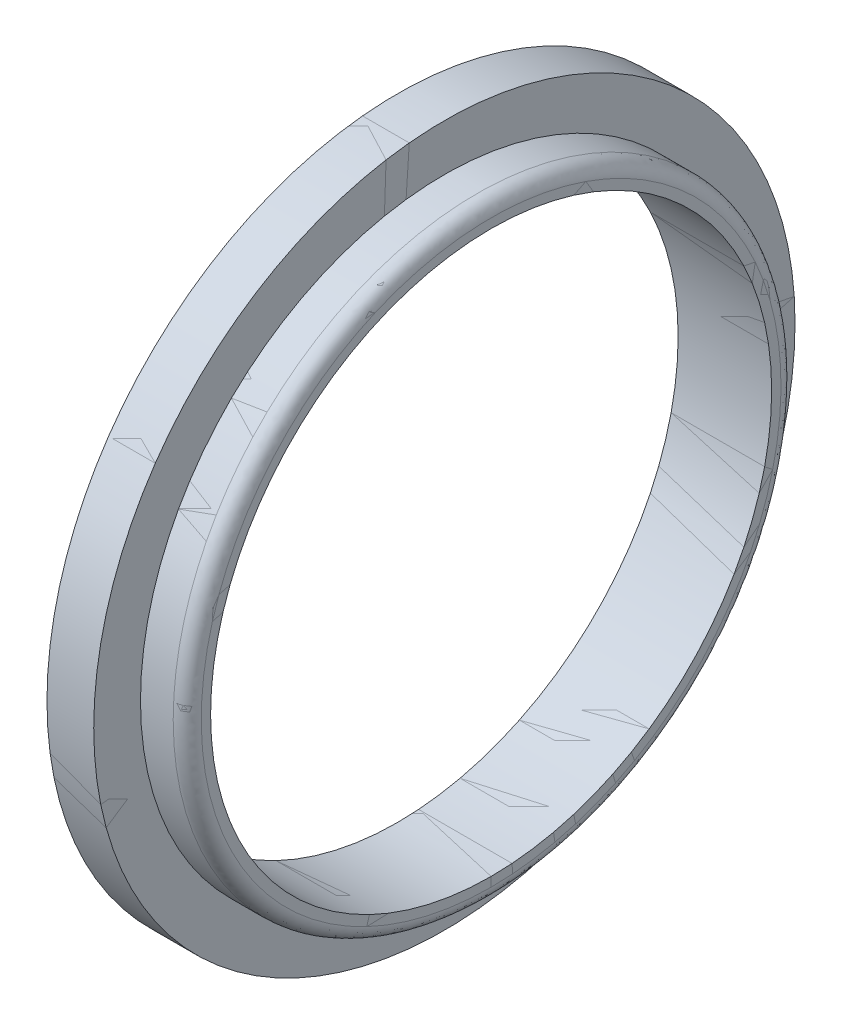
ISO-10303-21;
HEADER;
FILE_DESCRIPTION(('STEP AP214'),'2;1');
FILE_NAME('part.step','',(''),(''),'','','');
FILE_SCHEMA(('AUTOMOTIVE_DESIGN { 1 0 10303 214 1 1 1 1 }'));
ENDSEC;
DATA;
#1=APPLICATION_CONTEXT('core data for automotive mechanical design processes');
#2=APPLICATION_PROTOCOL_DEFINITION('international standard','automotive_design',2000,#1);
#3=PRODUCT_CONTEXT('',#1,'mechanical');
#4=PRODUCT('Part','Part','',(#3));
#5=PRODUCT_RELATED_PRODUCT_CATEGORY('part','',(#4));
#6=PRODUCT_DEFINITION_FORMATION('','',#4);
#7=PRODUCT_DEFINITION_CONTEXT('part definition',#1,'design');
#8=PRODUCT_DEFINITION('design','',#6,#7);
#9=PRODUCT_DEFINITION_SHAPE('','',#8);
#10=(LENGTH_UNIT() NAMED_UNIT(*) SI_UNIT(.MILLI.,.METRE.));
#11=(NAMED_UNIT(*) PLANE_ANGLE_UNIT() SI_UNIT($,.RADIAN.));
#12=(NAMED_UNIT(*) SI_UNIT($,.STERADIAN.) SOLID_ANGLE_UNIT());
#13=UNCERTAINTY_MEASURE_WITH_UNIT(LENGTH_MEASURE(1.E-05),#10,'distance_accuracy_value','');
#14=(GEOMETRIC_REPRESENTATION_CONTEXT(3) GLOBAL_UNCERTAINTY_ASSIGNED_CONTEXT((#13)) GLOBAL_UNIT_ASSIGNED_CONTEXT((#10,
#11,#12)) REPRESENTATION_CONTEXT('',''));
#15=CARTESIAN_POINT('',(0.,0.,0.));
#16=DIRECTION('',(0.,0.,1.));
#17=DIRECTION('',(1.,0.,0.));
#18=AXIS2_PLACEMENT_3D('',#15,#16,#17);
#19=CARTESIAN_POINT('',(1.7,0.,0.));
#20=DIRECTION('',(-1.,0.,0.));
#21=DIRECTION('',(0.,0.,1.));
#22=AXIS2_PLACEMENT_3D('',#19,#20,#21);
#23=CYLINDRICAL_SURFACE('',#22,6.50000000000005);
#24=CARTESIAN_POINT('',(1.7,0.,0.));
#25=DIRECTION('',(-1.,0.,0.));
#26=DIRECTION('',(0.,0.809016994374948,0.587785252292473));
#27=AXIS2_PLACEMENT_3D('',#24,#25,#26);
#28=CIRCLE('',#27,6.50000000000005);
#29=CARTESIAN_POINT('',(1.7,5.2586104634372,3.8206041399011));
#30=VERTEX_POINT('',#29);
#31=EDGE_CURVE('P0_E383',#30,#30,#28,.F.);
#32=ORIENTED_EDGE('',*,*,#31,.F.);
#33=EDGE_LOOP('',(#32));
#34=FACE_BOUND('',#33,.T.);
#35=CARTESIAN_POINT('',(1.,0.,0.));
#36=DIRECTION('',(-1.,0.,0.));
#37=DIRECTION('',(0.,0.,1.));
#38=AXIS2_PLACEMENT_3D('',#35,#36,#37);
#39=CIRCLE('',#38,6.50000000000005);
#40=CARTESIAN_POINT('',(1.,0.,6.50000000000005));
#41=VERTEX_POINT('',#40);
#42=EDGE_CURVE('P0_E381',#41,#41,#39,.T.);
#43=ORIENTED_EDGE('',*,*,#42,.F.);
#44=EDGE_LOOP('',(#43));
#45=FACE_BOUND('',#44,.T.);
#46=ADVANCED_FACE('P0_F348',(#34,#45),#23,.T.);
#47=CARTESIAN_POINT('',(1.7,5.2586104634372,3.8206041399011));
#48=CARTESIAN_POINT('',(2.,5.2586104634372,3.8206041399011));
#49=CARTESIAN_POINT('',(2.,5.0159053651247,3.6442685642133));
#50=CARTESIAN_POINT('',(2.,4.7732002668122,3.4679329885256));
#51=CARTESIAN_POINT('',(1.7,4.7732002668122,3.4679329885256));
#52=CARTESIAN_POINT('',(1.4,4.7732002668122,3.4679329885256));
#53=CARTESIAN_POINT('',(1.4,5.0159053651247,3.6442685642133));
#54=CARTESIAN_POINT('',(1.4,5.2586104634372,3.8206041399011));
#55=CARTESIAN_POINT('',(1.7,5.2586104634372,3.8206041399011));
#56=(BOUNDED_CURVE() B_SPLINE_CURVE(2,(#47,#48,#49,#50,#51,#52,#53,#54,#55),.UNSPECIFIED.,.T.,
.F.) B_SPLINE_CURVE_WITH_KNOTS((3,2,2,2,3),(0.,0.25,0.5,0.75,1.),
.UNSPECIFIED.) CURVE() GEOMETRIC_REPRESENTATION_ITEM() RATIONAL_B_SPLINE_CURVE((1.,
0.70710678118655,1.,0.70710678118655,1.,0.70710678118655,1.,0.70710678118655,1.)) REPRESENTATION_ITEM(''));
#57=CARTESIAN_POINT('',(2.,0.,0.));
#58=DIRECTION('',(-1.,0.,0.));
#59=AXIS1_PLACEMENT('',#57,#58);
#60=SURFACE_OF_REVOLUTION('',#56,#59);
#61=CARTESIAN_POINT('',(2.,0.,0.));
#62=DIRECTION('',(-1.,0.,0.));
#63=DIRECTION('',(0.,0.809016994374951,0.587785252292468));
#64=AXIS2_PLACEMENT_3D('',#61,#62,#63);
#65=CIRCLE('',#64,6.2);
#66=CARTESIAN_POINT('',(2.,5.0159053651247,3.6442685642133));
#67=VERTEX_POINT('',#66);
#68=EDGE_CURVE('P0_E379',#67,#67,#65,.F.);
#69=ORIENTED_EDGE('',*,*,#68,.F.);
#70=EDGE_LOOP('',(#69));
#71=FACE_BOUND('',#70,.T.);
#72=ORIENTED_EDGE('',*,*,#31,.T.);
#73=EDGE_LOOP('',(#72));
#74=FACE_BOUND('',#73,.T.);
#75=ADVANCED_FACE('P0_F404',(#71,#74),#60,.F.);
#76=CARTESIAN_POINT('',(1.,-1.6592380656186,-10.476016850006));
#77=DIRECTION('',(1.,0.,0.));
#78=DIRECTION('',(0.,0.809016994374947,0.587785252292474));
#79=AXIS2_PLACEMENT_3D('',#76,#77,#78);
#80=PLANE('',#79);
#81=ORIENTED_EDGE('',*,*,#42,.T.);
#82=EDGE_LOOP('',(#81));
#83=FACE_BOUND('',#82,.T.);
#84=CARTESIAN_POINT('',(1.,0.,0.));
#85=DIRECTION('',(-1.,0.,0.));
#86=DIRECTION('',(0.,0.,1.));
#87=AXIS2_PLACEMENT_3D('',#84,#85,#86);
#88=CIRCLE('',#87,7.49999999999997);
#89=CARTESIAN_POINT('',(1.,0.,7.49999999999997));
#90=VERTEX_POINT('',#89);
#91=EDGE_CURVE('P0_E374',#90,#90,#88,.F.);
#92=ORIENTED_EDGE('',*,*,#91,.T.);
#93=EDGE_LOOP('',(#92));
#94=FACE_BOUND('',#93,.T.);
#95=ADVANCED_FACE('P0_F414',(#83,#94),#80,.T.);
#96=CARTESIAN_POINT('',(2.,-1.3716368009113,-8.660173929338));
#97=DIRECTION('',(1.,0.,0.));
#98=DIRECTION('',(0.,0.809016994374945,0.587785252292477));
#99=AXIS2_PLACEMENT_3D('',#96,#97,#98);
#100=PLANE('',#99);
#101=CARTESIAN_POINT('',(2.,0.,0.));
#102=DIRECTION('',(-1.,0.,0.));
#103=DIRECTION('',(0.,0.,1.));
#104=AXIS2_PLACEMENT_3D('',#101,#102,#103);
#105=CIRCLE('',#104,5.99999999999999);
#106=CARTESIAN_POINT('',(2.,0.,5.99999999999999));
#107=VERTEX_POINT('',#106);
#108=EDGE_CURVE('P0_E361',#107,#107,#105,.F.);
#109=ORIENTED_EDGE('',*,*,#108,.F.);
#110=EDGE_LOOP('',(#109));
#111=FACE_BOUND('',#110,.T.);
#112=ORIENTED_EDGE('',*,*,#68,.T.);
#113=EDGE_LOOP('',(#112));
#114=FACE_BOUND('',#113,.T.);
#115=ADVANCED_FACE('P0_F419',(#111,#114),#100,.T.);
#116=CARTESIAN_POINT('',(1.,0.,0.));
#117=DIRECTION('',(-1.,0.,0.));
#118=DIRECTION('',(0.,0.,1.));
#119=AXIS2_PLACEMENT_3D('',#116,#117,#118);
#120=CYLINDRICAL_SURFACE('',#119,7.49999999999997);
#121=ORIENTED_EDGE('',*,*,#91,.F.);
#122=EDGE_LOOP('',(#121));
#123=FACE_BOUND('',#122,.T.);
#124=CARTESIAN_POINT('',(0.,0.,0.));
#125=DIRECTION('',(-1.,0.,0.));
#126=DIRECTION('',(0.,0.,1.));
#127=AXIS2_PLACEMENT_3D('',#124,#125,#126);
#128=CIRCLE('',#127,7.49999999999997);
#129=CARTESIAN_POINT('',(0.,0.,7.49999999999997));
#130=VERTEX_POINT('',#129);
#131=EDGE_CURVE('P0_E356',#130,#130,#128,.T.);
#132=ORIENTED_EDGE('',*,*,#131,.F.);
#133=EDGE_LOOP('',(#132));
#134=FACE_BOUND('',#133,.T.);
#135=ADVANCED_FACE('P0_F415',(#123,#134),#120,.T.);
#136=CARTESIAN_POINT('',(2.,0.,0.));
#137=DIRECTION('',(-1.,0.,0.));
#138=DIRECTION('',(0.,0.,1.));
#139=AXIS2_PLACEMENT_3D('',#136,#137,#138);
#140=CYLINDRICAL_SURFACE('',#139,5.99999999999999);
#141=CARTESIAN_POINT('',(0.,0.,0.));
#142=DIRECTION('',(-1.,0.,0.));
#143=DIRECTION('',(0.,0.,1.));
#144=AXIS2_PLACEMENT_3D('',#141,#142,#143);
#145=CIRCLE('',#144,5.99999999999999);
#146=CARTESIAN_POINT('',(0.,0.,5.99999999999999));
#147=VERTEX_POINT('',#146);
#148=EDGE_CURVE('P0_E10',#147,#147,#145,.F.);
#149=ORIENTED_EDGE('',*,*,#148,.F.);
#150=EDGE_LOOP('',(#149));
#151=FACE_BOUND('',#150,.T.);
#152=ORIENTED_EDGE('',*,*,#108,.T.);
#153=EDGE_LOOP('',(#152));
#154=FACE_BOUND('',#153,.T.);
#155=ADVANCED_FACE('P0_F418',(#151,#154),#140,.F.);
#156=CARTESIAN_POINT('',(0.,-10.476016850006,1.6592380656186));
#157=DIRECTION('',(-1.,0.,0.));
#158=DIRECTION('',(0.,0.809016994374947,0.587785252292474));
#159=AXIS2_PLACEMENT_3D('',#156,#157,#158);
#160=PLANE('',#159);
#161=ORIENTED_EDGE('',*,*,#148,.T.);
#162=EDGE_LOOP('',(#161));
#163=FACE_BOUND('',#162,.T.);
#164=ORIENTED_EDGE('',*,*,#131,.T.);
#165=EDGE_LOOP('',(#164));
#166=FACE_BOUND('',#165,.T.);
#167=ADVANCED_FACE('P0_F350',(#163,#166),#160,.T.);
#168=CLOSED_SHELL('',(#46,#75,#95,#115,#135,#155,#167));
#169=MANIFOLD_SOLID_BREP('P0_B2',#168);
#170=CARTESIAN_POINT('',(1.7,0.,0.));
#171=DIRECTION('',(-1.,0.,0.));
#172=DIRECTION('',(0.,0.,1.));
#173=AXIS2_PLACEMENT_3D('',#170,#171,#172);
#174=CYLINDRICAL_SURFACE('',#173,6.50000000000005);
#175=CARTESIAN_POINT('',(1.7,0.,0.));
#176=DIRECTION('',(-1.,0.,0.));
#177=DIRECTION('',(0.,0.809016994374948,0.587785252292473));
#178=AXIS2_PLACEMENT_3D('',#175,#176,#177);
#179=CIRCLE('',#178,6.50000000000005);
#180=CARTESIAN_POINT('',(1.7,5.2586104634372,3.8206041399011));
#181=VERTEX_POINT('',#180);
#182=EDGE_CURVE('P1_E49',#181,#181,#179,.F.);
#183=ORIENTED_EDGE('',*,*,#182,.F.);
#184=EDGE_LOOP('',(#183));
#185=FACE_BOUND('',#184,.T.);
#186=CARTESIAN_POINT('',(1.,0.,0.));
#187=DIRECTION('',(-1.,0.,0.));
#188=DIRECTION('',(0.,0.,1.));
#189=AXIS2_PLACEMENT_3D('',#186,#187,#188);
#190=CIRCLE('',#189,6.50000000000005);
#191=CARTESIAN_POINT('',(1.,0.,6.50000000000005));
#192=VERTEX_POINT('',#191);
#193=EDGE_CURVE('P1_E47',#192,#192,#190,.T.);
#194=ORIENTED_EDGE('',*,*,#193,.F.);
#195=EDGE_LOOP('',(#194));
#196=FACE_BOUND('',#195,.T.);
#197=ADVANCED_FACE('P1_F14',(#185,#196),#174,.T.);
#198=CARTESIAN_POINT('',(1.7,5.2586104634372,3.8206041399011));
#199=CARTESIAN_POINT('',(2.,5.2586104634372,3.8206041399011));
#200=CARTESIAN_POINT('',(2.,5.0159053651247,3.6442685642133));
#201=CARTESIAN_POINT('',(2.,4.7732002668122,3.4679329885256));
#202=CARTESIAN_POINT('',(1.7,4.7732002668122,3.4679329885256));
#203=CARTESIAN_POINT('',(1.4,4.7732002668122,3.4679329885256));
#204=CARTESIAN_POINT('',(1.4,5.0159053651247,3.6442685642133));
#205=CARTESIAN_POINT('',(1.4,5.2586104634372,3.8206041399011));
#206=CARTESIAN_POINT('',(1.7,5.2586104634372,3.8206041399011));
#207=(BOUNDED_CURVE() B_SPLINE_CURVE(2,(#198,#199,#200,#201,#202,#203,#204,#205,#206),
.UNSPECIFIED.,.T.,.F.) B_SPLINE_CURVE_WITH_KNOTS((3,2,2,2,3),(0.,0.25,0.5,0.75,1.),
.UNSPECIFIED.) CURVE() GEOMETRIC_REPRESENTATION_ITEM() RATIONAL_B_SPLINE_CURVE((1.,
0.70710678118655,1.,0.70710678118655,1.,0.70710678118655,1.,0.70710678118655,1.)) REPRESENTATION_ITEM(''));
#208=CARTESIAN_POINT('',(2.,0.,0.));
#209=DIRECTION('',(-1.,0.,0.));
#210=AXIS1_PLACEMENT('',#208,#209);
#211=SURFACE_OF_REVOLUTION('',#207,#210);
#212=CARTESIAN_POINT('',(2.,0.,0.));
#213=DIRECTION('',(-1.,0.,0.));
#214=DIRECTION('',(0.,0.809016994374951,0.587785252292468));
#215=AXIS2_PLACEMENT_3D('',#212,#213,#214);
#216=CIRCLE('',#215,6.2);
#217=CARTESIAN_POINT('',(2.,5.0159053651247,3.6442685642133));
#218=VERTEX_POINT('',#217);
#219=EDGE_CURVE('P1_E45',#218,#218,#216,.F.);
#220=ORIENTED_EDGE('',*,*,#219,.F.);
#221=EDGE_LOOP('',(#220));
#222=FACE_BOUND('',#221,.T.);
#223=ORIENTED_EDGE('',*,*,#182,.T.);
#224=EDGE_LOOP('',(#223));
#225=FACE_BOUND('',#224,.T.);
#226=ADVANCED_FACE('P1_F70',(#222,#225),#211,.F.);
#227=CARTESIAN_POINT('',(1.,-1.6592380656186,-10.476016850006));
#228=DIRECTION('',(1.,0.,0.));
#229=DIRECTION('',(0.,0.809016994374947,0.587785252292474));
#230=AXIS2_PLACEMENT_3D('',#227,#228,#229);
#231=PLANE('',#230);
#232=ORIENTED_EDGE('',*,*,#193,.T.);
#233=EDGE_LOOP('',(#232));
#234=FACE_BOUND('',#233,.T.);
#235=CARTESIAN_POINT('',(1.,0.,0.));
#236=DIRECTION('',(-1.,0.,0.));
#237=DIRECTION('',(0.,0.,1.));
#238=AXIS2_PLACEMENT_3D('',#235,#236,#237);
#239=CIRCLE('',#238,7.49999999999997);
#240=CARTESIAN_POINT('',(1.,0.,7.49999999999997));
#241=VERTEX_POINT('',#240);
#242=EDGE_CURVE('P1_E40',#241,#241,#239,.F.);
#243=ORIENTED_EDGE('',*,*,#242,.T.);
#244=EDGE_LOOP('',(#243));
#245=FACE_BOUND('',#244,.T.);
#246=ADVANCED_FACE('P1_F79',(#234,#245),#231,.T.);
#247=CARTESIAN_POINT('',(2.,-1.3716368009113,-8.660173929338));
#248=DIRECTION('',(1.,0.,0.));
#249=DIRECTION('',(0.,0.809016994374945,0.587785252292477));
#250=AXIS2_PLACEMENT_3D('',#247,#248,#249);
#251=PLANE('',#250);
#252=CARTESIAN_POINT('',(2.,0.,0.));
#253=DIRECTION('',(-1.,0.,0.));
#254=DIRECTION('',(0.,0.,1.));
#255=AXIS2_PLACEMENT_3D('',#252,#253,#254);
#256=CIRCLE('',#255,5.99999999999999);
#257=CARTESIAN_POINT('',(2.,0.,5.99999999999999));
#258=VERTEX_POINT('',#257);
#259=EDGE_CURVE('P1_E27',#258,#258,#256,.F.);
#260=ORIENTED_EDGE('',*,*,#259,.F.);
#261=EDGE_LOOP('',(#260));
#262=FACE_BOUND('',#261,.T.);
#263=ORIENTED_EDGE('',*,*,#219,.T.);
#264=EDGE_LOOP('',(#263));
#265=FACE_BOUND('',#264,.T.);
#266=ADVANCED_FACE('P1_F83',(#262,#265),#251,.T.);
#267=CARTESIAN_POINT('',(1.,0.,0.));
#268=DIRECTION('',(-1.,0.,0.));
#269=DIRECTION('',(0.,0.,1.));
#270=AXIS2_PLACEMENT_3D('',#267,#268,#269);
#271=CYLINDRICAL_SURFACE('',#270,7.49999999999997);
#272=ORIENTED_EDGE('',*,*,#242,.F.);
#273=EDGE_LOOP('',(#272));
#274=FACE_BOUND('',#273,.T.);
#275=CARTESIAN_POINT('',(0.,0.,0.));
#276=DIRECTION('',(-1.,0.,0.));
#277=DIRECTION('',(0.,0.,1.));
#278=AXIS2_PLACEMENT_3D('',#275,#276,#277);
#279=CIRCLE('',#278,7.49999999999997);
#280=CARTESIAN_POINT('',(0.,0.,7.49999999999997));
#281=VERTEX_POINT('',#280);
#282=EDGE_CURVE('P1_E22',#281,#281,#279,.T.);
#283=ORIENTED_EDGE('',*,*,#282,.F.);
#284=EDGE_LOOP('',(#283));
#285=FACE_BOUND('',#284,.T.);
#286=ADVANCED_FACE('P1_F80',(#274,#285),#271,.T.);
#287=CARTESIAN_POINT('',(2.,0.,0.));
#288=DIRECTION('',(-1.,0.,0.));
#289=DIRECTION('',(0.,0.,1.));
#290=AXIS2_PLACEMENT_3D('',#287,#288,#289);
#291=CYLINDRICAL_SURFACE('',#290,5.99999999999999);
#292=CARTESIAN_POINT('',(0.,0.,0.));
#293=DIRECTION('',(-1.,0.,0.));
#294=DIRECTION('',(0.,0.,1.));
#295=AXIS2_PLACEMENT_3D('',#292,#293,#294);
#296=CIRCLE('',#295,5.99999999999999);
#297=CARTESIAN_POINT('',(0.,0.,5.99999999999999));
#298=VERTEX_POINT('',#297);
#299=EDGE_CURVE('P1_E9',#298,#298,#296,.F.);
#300=ORIENTED_EDGE('',*,*,#299,.F.);
#301=EDGE_LOOP('',(#300));
#302=FACE_BOUND('',#301,.T.);
#303=ORIENTED_EDGE('',*,*,#259,.T.);
#304=EDGE_LOOP('',(#303));
#305=FACE_BOUND('',#304,.T.);
#306=ADVANCED_FACE('P1_F82',(#302,#305),#291,.F.);
#307=CARTESIAN_POINT('',(0.,-10.476016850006,1.6592380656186));
#308=DIRECTION('',(-1.,0.,0.));
#309=DIRECTION('',(0.,0.809016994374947,0.587785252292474));
#310=AXIS2_PLACEMENT_3D('',#307,#308,#309);
#311=PLANE('',#310);
#312=ORIENTED_EDGE('',*,*,#299,.T.);
#313=EDGE_LOOP('',(#312));
#314=FACE_BOUND('',#313,.T.);
#315=ORIENTED_EDGE('',*,*,#282,.T.);
#316=EDGE_LOOP('',(#315));
#317=FACE_BOUND('',#316,.T.);
#318=ADVANCED_FACE('P1_F16',(#314,#317),#311,.T.);
#319=CLOSED_SHELL('',(#197,#226,#246,#266,#286,#306,#318));
#320=MANIFOLD_SOLID_BREP('P1_B1',#319);
#321=ADVANCED_BREP_SHAPE_REPRESENTATION('',(#18,#169,#320),#14);
#322=SHAPE_DEFINITION_REPRESENTATION(#9,#321);
ENDSEC;
END-ISO-10303-21;
